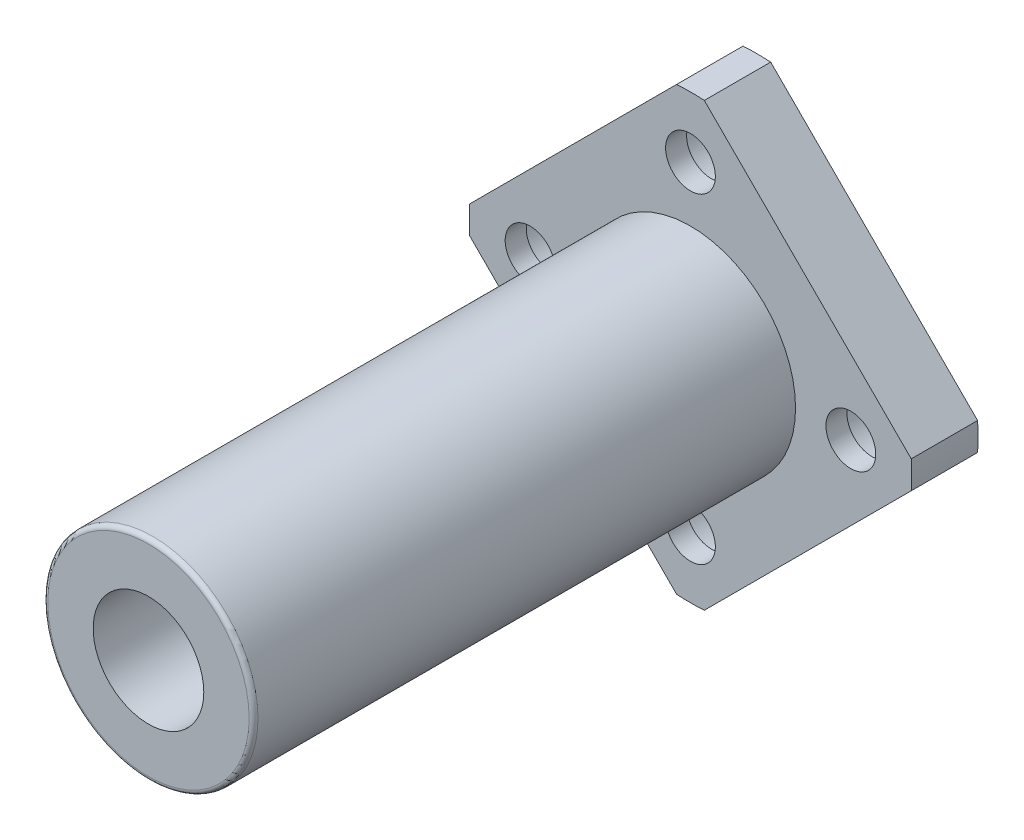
ISO-10303-21;
HEADER;
FILE_DESCRIPTION(('STEP AP214'),'2;1');
FILE_NAME('part.step','',(''),(''),'','','');
FILE_SCHEMA(('AUTOMOTIVE_DESIGN { 1 0 10303 214 1 1 1 1 }'));
ENDSEC;
DATA;
#1=APPLICATION_CONTEXT('core data for automotive mechanical design processes');
#2=APPLICATION_PROTOCOL_DEFINITION('international standard','automotive_design',2000,#1);
#3=PRODUCT_CONTEXT('',#1,'mechanical');
#4=PRODUCT('Part','Part','',(#3));
#5=PRODUCT_RELATED_PRODUCT_CATEGORY('part','',(#4));
#6=PRODUCT_DEFINITION_FORMATION('','',#4);
#7=PRODUCT_DEFINITION_CONTEXT('part definition',#1,'design');
#8=PRODUCT_DEFINITION('design','',#6,#7);
#9=PRODUCT_DEFINITION_SHAPE('','',#8);
#10=(LENGTH_UNIT() NAMED_UNIT(*) SI_UNIT(.MILLI.,.METRE.));
#11=(NAMED_UNIT(*) PLANE_ANGLE_UNIT() SI_UNIT($,.RADIAN.));
#12=(NAMED_UNIT(*) SI_UNIT($,.STERADIAN.) SOLID_ANGLE_UNIT());
#13=UNCERTAINTY_MEASURE_WITH_UNIT(LENGTH_MEASURE(1.E-05),#10,'distance_accuracy_value','');
#14=(GEOMETRIC_REPRESENTATION_CONTEXT(3) GLOBAL_UNCERTAINTY_ASSIGNED_CONTEXT((#13)) GLOBAL_UNIT_ASSIGNED_CONTEXT((#10,
#11,#12)) REPRESENTATION_CONTEXT('',''));
#15=CARTESIAN_POINT('',(0.,0.,0.));
#16=DIRECTION('',(0.,0.,1.));
#17=DIRECTION('',(1.,0.,0.));
#18=AXIS2_PLACEMENT_3D('',#15,#16,#17);
#19=CARTESIAN_POINT('',(-14.5,0.,0.));
#20=DIRECTION('',(0.,0.,1.));
#21=DIRECTION('',(1.,0.,0.));
#22=AXIS2_PLACEMENT_3D('',#19,#20,#21);
#23=CYLINDRICAL_SURFACE('',#22,3.75);
#24=CARTESIAN_POINT('',(-14.5,0.,4.1));
#25=DIRECTION('',(0.,0.,1.));
#26=DIRECTION('',(1.,0.,0.));
#27=AXIS2_PLACEMENT_3D('',#24,#25,#26);
#28=CIRCLE('',#27,3.75);
#29=CARTESIAN_POINT('',(-10.75,0.,4.1));
#30=VERTEX_POINT('',#29);
#31=EDGE_CURVE('E19',#30,#30,#28,.F.);
#32=ORIENTED_EDGE('',*,*,#31,.F.);
#33=EDGE_LOOP('',(#32));
#34=FACE_BOUND('',#33,.T.);
#35=CARTESIAN_POINT('',(-14.5,0.,0.));
#36=DIRECTION('',(0.,0.,1.));
#37=DIRECTION('',(1.,0.,0.));
#38=AXIS2_PLACEMENT_3D('',#35,#36,#37);
#39=CIRCLE('',#38,3.75);
#40=CARTESIAN_POINT('',(-10.75,0.,0.));
#41=VERTEX_POINT('',#40);
#42=EDGE_CURVE('E249',#41,#41,#39,.T.);
#43=ORIENTED_EDGE('',*,*,#42,.F.);
#44=EDGE_LOOP('',(#43));
#45=FACE_BOUND('',#44,.T.);
#46=ADVANCED_FACE('F16',(#34,#45),#23,.F.);
#47=CARTESIAN_POINT('',(0.,14.5,0.));
#48=DIRECTION('',(0.,0.,1.));
#49=DIRECTION('',(1.,0.,0.));
#50=AXIS2_PLACEMENT_3D('',#47,#48,#49);
#51=CYLINDRICAL_SURFACE('',#50,3.75);
#52=CARTESIAN_POINT('',(0.,14.5,4.1));
#53=DIRECTION('',(0.,0.,1.));
#54=DIRECTION('',(1.,0.,0.));
#55=AXIS2_PLACEMENT_3D('',#52,#53,#54);
#56=CIRCLE('',#55,3.75);
#57=CARTESIAN_POINT('',(3.75,14.5,4.1));
#58=VERTEX_POINT('',#57);
#59=EDGE_CURVE('E251',#58,#58,#56,.F.);
#60=ORIENTED_EDGE('',*,*,#59,.F.);
#61=EDGE_LOOP('',(#60));
#62=FACE_BOUND('',#61,.T.);
#63=CARTESIAN_POINT('',(0.,14.5,0.));
#64=DIRECTION('',(0.,0.,1.));
#65=DIRECTION('',(1.,0.,0.));
#66=AXIS2_PLACEMENT_3D('',#63,#64,#65);
#67=CIRCLE('',#66,3.75);
#68=CARTESIAN_POINT('',(3.75,14.5,0.));
#69=VERTEX_POINT('',#68);
#70=EDGE_CURVE('E246',#69,#69,#67,.T.);
#71=ORIENTED_EDGE('',*,*,#70,.F.);
#72=EDGE_LOOP('',(#71));
#73=FACE_BOUND('',#72,.T.);
#74=ADVANCED_FACE('F161',(#62,#73),#51,.F.);
#75=CARTESIAN_POINT('',(0.,-14.5,6.));
#76=DIRECTION('',(0.,0.,-1.));
#77=DIRECTION('',(-1.,0.,0.));
#78=AXIS2_PLACEMENT_3D('',#75,#76,#77);
#79=CYLINDRICAL_SURFACE('',#78,3.75);
#80=CARTESIAN_POINT('',(0.,-14.5,0.));
#81=DIRECTION('',(0.,0.,-1.));
#82=DIRECTION('',(-1.,0.,0.));
#83=AXIS2_PLACEMENT_3D('',#80,#81,#82);
#84=CIRCLE('',#83,3.75);
#85=CARTESIAN_POINT('',(-3.75,-14.5,0.));
#86=VERTEX_POINT('',#85);
#87=EDGE_CURVE('E240',#86,#86,#84,.F.);
#88=ORIENTED_EDGE('',*,*,#87,.F.);
#89=EDGE_LOOP('',(#88));
#90=FACE_BOUND('',#89,.T.);
#91=CARTESIAN_POINT('',(0.,-14.5,4.1));
#92=DIRECTION('',(0.,0.,-1.));
#93=DIRECTION('',(-1.,0.,0.));
#94=AXIS2_PLACEMENT_3D('',#91,#92,#93);
#95=CIRCLE('',#94,3.75);
#96=CARTESIAN_POINT('',(-3.75,-14.5,4.1));
#97=VERTEX_POINT('',#96);
#98=EDGE_CURVE('E234',#97,#97,#95,.T.);
#99=ORIENTED_EDGE('',*,*,#98,.F.);
#100=EDGE_LOOP('',(#99));
#101=FACE_BOUND('',#100,.T.);
#102=ADVANCED_FACE('F158',(#90,#101),#79,.F.);
#103=CARTESIAN_POINT('',(14.5,0.,6.));
#104=DIRECTION('',(0.,0.,-1.));
#105=DIRECTION('',(-1.,0.,0.));
#106=AXIS2_PLACEMENT_3D('',#103,#104,#105);
#107=CYLINDRICAL_SURFACE('',#106,3.75);
#108=CARTESIAN_POINT('',(14.5,0.,0.));
#109=DIRECTION('',(0.,0.,-1.));
#110=DIRECTION('',(-1.,0.,0.));
#111=AXIS2_PLACEMENT_3D('',#108,#109,#110);
#112=CIRCLE('',#111,3.75);
#113=CARTESIAN_POINT('',(10.75,0.,0.));
#114=VERTEX_POINT('',#113);
#115=EDGE_CURVE('E237',#114,#114,#112,.F.);
#116=ORIENTED_EDGE('',*,*,#115,.F.);
#117=EDGE_LOOP('',(#116));
#118=FACE_BOUND('',#117,.T.);
#119=CARTESIAN_POINT('',(14.5,0.,4.1));
#120=DIRECTION('',(0.,0.,-1.));
#121=DIRECTION('',(-1.,0.,0.));
#122=AXIS2_PLACEMENT_3D('',#119,#120,#121);
#123=CIRCLE('',#122,3.75);
#124=CARTESIAN_POINT('',(10.75,0.,4.1));
#125=VERTEX_POINT('',#124);
#126=EDGE_CURVE('E231',#125,#125,#123,.T.);
#127=ORIENTED_EDGE('',*,*,#126,.F.);
#128=EDGE_LOOP('',(#127));
#129=FACE_BOUND('',#128,.T.);
#130=ADVANCED_FACE('F154',(#118,#129),#107,.F.);
#131=CARTESIAN_POINT('',(0.,0.,0.));
#132=DIRECTION('',(0.,0.,1.));
#133=DIRECTION('',(1.,0.,0.));
#134=AXIS2_PLACEMENT_3D('',#131,#132,#133);
#135=CYLINDRICAL_SURFACE('',#134,5.);
#136=CARTESIAN_POINT('',(0.,0.,55.));
#137=DIRECTION('',(0.,0.,1.));
#138=DIRECTION('',(1.,0.,0.));
#139=AXIS2_PLACEMENT_3D('',#136,#137,#138);
#140=CIRCLE('',#139,5.);
#141=CARTESIAN_POINT('',(5.,0.,55.));
#142=VERTEX_POINT('',#141);
#143=EDGE_CURVE('E228',#142,#142,#140,.F.);
#144=ORIENTED_EDGE('',*,*,#143,.F.);
#145=EDGE_LOOP('',(#144));
#146=FACE_BOUND('',#145,.T.);
#147=CARTESIAN_POINT('',(0.,0.,0.));
#148=DIRECTION('',(0.,0.,1.));
#149=DIRECTION('',(1.,0.,0.));
#150=AXIS2_PLACEMENT_3D('',#147,#148,#149);
#151=CIRCLE('',#150,5.);
#152=CARTESIAN_POINT('',(5.,0.,0.));
#153=VERTEX_POINT('',#152);
#154=EDGE_CURVE('E243',#153,#153,#151,.T.);
#155=ORIENTED_EDGE('',*,*,#154,.F.);
#156=EDGE_LOOP('',(#155));
#157=FACE_BOUND('',#156,.T.);
#158=ADVANCED_FACE('F150',(#146,#157),#135,.F.);
#159=CARTESIAN_POINT('',(-16.75,0.,4.1));
#160=DIRECTION('',(0.,0.,-1.));
#161=DIRECTION('',(-1.,0.,0.));
#162=AXIS2_PLACEMENT_3D('',#159,#160,#161);
#163=PLANE('',#162);
#164=CARTESIAN_POINT('',(-14.5,0.,4.1));
#165=DIRECTION('',(0.,0.,1.));
#166=DIRECTION('',(1.,0.,0.));
#167=AXIS2_PLACEMENT_3D('',#164,#165,#166);
#168=CIRCLE('',#167,2.25);
#169=CARTESIAN_POINT('',(-12.25,0.,4.1));
#170=VERTEX_POINT('',#169);
#171=EDGE_CURVE('E225',#170,#170,#168,.T.);
#172=ORIENTED_EDGE('',*,*,#171,.T.);
#173=EDGE_LOOP('',(#172));
#174=FACE_BOUND('',#173,.T.);
#175=ORIENTED_EDGE('',*,*,#31,.T.);
#176=EDGE_LOOP('',(#175));
#177=FACE_BOUND('',#176,.T.);
#178=ADVANCED_FACE('F146',(#174,#177),#163,.T.);
#179=CARTESIAN_POINT('',(0.,16.75,4.1));
#180=DIRECTION('',(0.,0.,-1.));
#181=DIRECTION('',(-1.,0.,0.));
#182=AXIS2_PLACEMENT_3D('',#179,#180,#181);
#183=PLANE('',#182);
#184=CARTESIAN_POINT('',(0.,14.5,4.1));
#185=DIRECTION('',(0.,0.,1.));
#186=DIRECTION('',(1.,0.,0.));
#187=AXIS2_PLACEMENT_3D('',#184,#185,#186);
#188=CIRCLE('',#187,2.25);
#189=CARTESIAN_POINT('',(2.25,14.5,4.1));
#190=VERTEX_POINT('',#189);
#191=EDGE_CURVE('E222',#190,#190,#188,.T.);
#192=ORIENTED_EDGE('',*,*,#191,.T.);
#193=EDGE_LOOP('',(#192));
#194=FACE_BOUND('',#193,.T.);
#195=ORIENTED_EDGE('',*,*,#59,.T.);
#196=EDGE_LOOP('',(#195));
#197=FACE_BOUND('',#196,.T.);
#198=ADVANCED_FACE('F142',(#194,#197),#183,.T.);
#199=CARTESIAN_POINT('',(0.,5.,0.));
#200=DIRECTION('',(0.,0.,-1.));
#201=DIRECTION('',(-1.,0.,0.));
#202=AXIS2_PLACEMENT_3D('',#199,#200,#201);
#203=PLANE('',#202);
#204=ORIENTED_EDGE('',*,*,#115,.T.);
#205=EDGE_LOOP('',(#204));
#206=FACE_BOUND('',#205,.T.);
#207=ORIENTED_EDGE('',*,*,#87,.T.);
#208=EDGE_LOOP('',(#207));
#209=FACE_BOUND('',#208,.T.);
#210=DIRECTION('',(-0.707106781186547,0.707106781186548,0.));
#211=VECTOR('',#210,1.);
#212=CARTESIAN_POINT('',(-19.9607451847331,-1.25245825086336,0.));
#213=LINE('',#212,#211);
#214=CARTESIAN_POINT('',(-1.25245825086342,-19.960745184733,0.));
#215=VERTEX_POINT('',#214);
#216=CARTESIAN_POINT('',(-19.960745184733,-1.25245825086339,0.));
#217=VERTEX_POINT('',#216);
#218=EDGE_CURVE('E92',#215,#217,#213,.T.);
#219=ORIENTED_EDGE('',*,*,#218,.T.);
#220=CARTESIAN_POINT('',(5.34294830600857E-13,0.,0.));
#221=DIRECTION('',(0.,0.,1.));
#222=DIRECTION('',(1.,0.,0.));
#223=AXIS2_PLACEMENT_3D('',#220,#221,#222);
#224=CIRCLE('',#223,20.0000000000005);
#225=CARTESIAN_POINT('',(-19.960745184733,1.25245825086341,0.));
#226=VERTEX_POINT('',#225);
#227=EDGE_CURVE('E79',#226,#217,#224,.T.);
#228=ORIENTED_EDGE('',*,*,#227,.F.);
#229=DIRECTION('',(0.707106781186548,0.707106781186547,0.));
#230=VECTOR('',#229,1.);
#231=CARTESIAN_POINT('',(-1.25245825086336,19.9607451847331,0.));
#232=LINE('',#231,#230);
#233=CARTESIAN_POINT('',(-1.25245825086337,19.960745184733,0.));
#234=VERTEX_POINT('',#233);
#235=EDGE_CURVE('E89',#226,#234,#232,.T.);
#236=ORIENTED_EDGE('',*,*,#235,.T.);
#237=CARTESIAN_POINT('',(0.,-4.92661467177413E-13,0.));
#238=DIRECTION('',(0.,0.,1.));
#239=DIRECTION('',(1.,0.,0.));
#240=AXIS2_PLACEMENT_3D('',#237,#238,#239);
#241=CIRCLE('',#240,20.0000000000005);
#242=CARTESIAN_POINT('',(1.25245825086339,19.960745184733,0.));
#243=VERTEX_POINT('',#242);
#244=EDGE_CURVE('E202',#243,#234,#241,.T.);
#245=ORIENTED_EDGE('',*,*,#244,.F.);
#246=DIRECTION('',(0.707106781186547,-0.707106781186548,0.));
#247=VECTOR('',#246,1.);
#248=CARTESIAN_POINT('',(19.9607451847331,1.25245825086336,0.));
#249=LINE('',#248,#247);
#250=CARTESIAN_POINT('',(19.960745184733,1.2524582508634,0.));
#251=VERTEX_POINT('',#250);
#252=EDGE_CURVE('E207',#243,#251,#249,.T.);
#253=ORIENTED_EDGE('',*,*,#252,.T.);
#254=CARTESIAN_POINT('',(-4.33680868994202E-13,0.,0.));
#255=DIRECTION('',(0.,0.,1.));
#256=DIRECTION('',(1.,0.,0.));
#257=AXIS2_PLACEMENT_3D('',#254,#255,#256);
#258=CIRCLE('',#257,20.0000000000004);
#259=CARTESIAN_POINT('',(19.960745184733,-1.25245825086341,0.));
#260=VERTEX_POINT('',#259);
#261=EDGE_CURVE('E210',#260,#251,#258,.T.);
#262=ORIENTED_EDGE('',*,*,#261,.F.);
#263=DIRECTION('',(-0.707106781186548,-0.707106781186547,0.));
#264=VECTOR('',#263,1.);
#265=CARTESIAN_POINT('',(1.25245825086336,-19.9607451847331,0.));
#266=LINE('',#265,#264);
#267=CARTESIAN_POINT('',(1.25245825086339,-19.960745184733,0.));
#268=VERTEX_POINT('',#267);
#269=EDGE_CURVE('E212',#260,#268,#266,.T.);
#270=ORIENTED_EDGE('',*,*,#269,.T.);
#271=CARTESIAN_POINT('',(0.,1.33226762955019E-12,0.));
#272=DIRECTION('',(0.,0.,1.));
#273=DIRECTION('',(1.,0.,0.));
#274=AXIS2_PLACEMENT_3D('',#271,#272,#273);
#275=CIRCLE('',#274,20.0000000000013);
#276=EDGE_CURVE('E96',#215,#268,#275,.T.);
#277=ORIENTED_EDGE('',*,*,#276,.F.);
#278=EDGE_LOOP('',(#219,#228,#236,#245,#253,#262,#270,#277));
#279=FACE_BOUND('',#278,.T.);
#280=ORIENTED_EDGE('',*,*,#154,.T.);
#281=EDGE_LOOP('',(#280));
#282=FACE_BOUND('',#281,.T.);
#283=ORIENTED_EDGE('',*,*,#70,.T.);
#284=EDGE_LOOP('',(#283));
#285=FACE_BOUND('',#284,.T.);
#286=ORIENTED_EDGE('',*,*,#42,.T.);
#287=EDGE_LOOP('',(#286));
#288=FACE_BOUND('',#287,.T.);
#289=ADVANCED_FACE('F93',(#206,#209,#279,#282,#285,#288),#203,.T.);
#290=CARTESIAN_POINT('',(0.,-18.25,4.1));
#291=DIRECTION('',(0.,0.,-1.));
#292=DIRECTION('',(-1.,0.,0.));
#293=AXIS2_PLACEMENT_3D('',#290,#291,#292);
#294=PLANE('',#293);
#295=ORIENTED_EDGE('',*,*,#98,.T.);
#296=EDGE_LOOP('',(#295));
#297=FACE_BOUND('',#296,.T.);
#298=CARTESIAN_POINT('',(0.,-14.5,4.1));
#299=DIRECTION('',(0.,0.,-1.));
#300=DIRECTION('',(-1.,0.,0.));
#301=AXIS2_PLACEMENT_3D('',#298,#299,#300);
#302=CIRCLE('',#301,2.25);
#303=CARTESIAN_POINT('',(-2.25,-14.5,4.1));
#304=VERTEX_POINT('',#303);
#305=EDGE_CURVE('E204',#304,#304,#302,.F.);
#306=ORIENTED_EDGE('',*,*,#305,.T.);
#307=EDGE_LOOP('',(#306));
#308=FACE_BOUND('',#307,.T.);
#309=ADVANCED_FACE('F135',(#297,#308),#294,.T.);
#310=CARTESIAN_POINT('',(18.25,0.,4.1));
#311=DIRECTION('',(0.,0.,-1.));
#312=DIRECTION('',(-1.,0.,0.));
#313=AXIS2_PLACEMENT_3D('',#310,#311,#312);
#314=PLANE('',#313);
#315=ORIENTED_EDGE('',*,*,#126,.T.);
#316=EDGE_LOOP('',(#315));
#317=FACE_BOUND('',#316,.T.);
#318=CARTESIAN_POINT('',(14.5,0.,4.1));
#319=DIRECTION('',(0.,0.,-1.));
#320=DIRECTION('',(-1.,0.,0.));
#321=AXIS2_PLACEMENT_3D('',#318,#319,#320);
#322=CIRCLE('',#321,2.25);
#323=CARTESIAN_POINT('',(12.25,0.,4.1));
#324=VERTEX_POINT('',#323);
#325=EDGE_CURVE('E272',#324,#324,#322,.F.);
#326=ORIENTED_EDGE('',*,*,#325,.T.);
#327=EDGE_LOOP('',(#326));
#328=FACE_BOUND('',#327,.T.);
#329=ADVANCED_FACE('F131',(#317,#328),#314,.T.);
#330=CARTESIAN_POINT('',(0.,9.1,55.));
#331=DIRECTION('',(0.,0.,1.));
#332=DIRECTION('',(1.,0.,0.));
#333=AXIS2_PLACEMENT_3D('',#330,#331,#332);
#334=PLANE('',#333);
#335=CARTESIAN_POINT('',(0.,0.,55.));
#336=DIRECTION('',(0.,0.,-1.));
#337=DIRECTION('',(-1.,0.,0.));
#338=AXIS2_PLACEMENT_3D('',#335,#336,#337);
#339=CIRCLE('',#338,9.1);
#340=CARTESIAN_POINT('',(-9.1,0.,55.));
#341=VERTEX_POINT('',#340);
#342=EDGE_CURVE('E114',#341,#341,#339,.T.);
#343=ORIENTED_EDGE('',*,*,#342,.F.);
#344=EDGE_LOOP('',(#343));
#345=FACE_BOUND('',#344,.T.);
#346=ORIENTED_EDGE('',*,*,#143,.T.);
#347=EDGE_LOOP('',(#346));
#348=FACE_BOUND('',#347,.T.);
#349=ADVANCED_FACE('F120',(#345,#348),#334,.T.);
#350=CARTESIAN_POINT('',(-14.5,0.,0.));
#351=DIRECTION('',(0.,0.,1.));
#352=DIRECTION('',(1.,0.,0.));
#353=AXIS2_PLACEMENT_3D('',#350,#351,#352);
#354=CYLINDRICAL_SURFACE('',#353,2.25);
#355=CARTESIAN_POINT('',(-14.5,0.,6.));
#356=DIRECTION('',(0.,0.,1.));
#357=DIRECTION('',(1.,0.,0.));
#358=AXIS2_PLACEMENT_3D('',#355,#356,#357);
#359=CIRCLE('',#358,2.25);
#360=CARTESIAN_POINT('',(-12.25,0.,6.));
#361=VERTEX_POINT('',#360);
#362=EDGE_CURVE('E307',#361,#361,#359,.F.);
#363=ORIENTED_EDGE('',*,*,#362,.F.);
#364=EDGE_LOOP('',(#363));
#365=FACE_BOUND('',#364,.T.);
#366=ORIENTED_EDGE('',*,*,#171,.F.);
#367=EDGE_LOOP('',(#366));
#368=FACE_BOUND('',#367,.T.);
#369=ADVANCED_FACE('F130',(#365,#368),#354,.F.);
#370=CARTESIAN_POINT('',(0.,14.5,0.));
#371=DIRECTION('',(0.,0.,1.));
#372=DIRECTION('',(1.,0.,0.));
#373=AXIS2_PLACEMENT_3D('',#370,#371,#372);
#374=CYLINDRICAL_SURFACE('',#373,2.25);
#375=CARTESIAN_POINT('',(0.,14.5,6.));
#376=DIRECTION('',(0.,0.,1.));
#377=DIRECTION('',(1.,0.,0.));
#378=AXIS2_PLACEMENT_3D('',#375,#376,#377);
#379=CIRCLE('',#378,2.25);
#380=CARTESIAN_POINT('',(2.25,14.5,6.));
#381=VERTEX_POINT('',#380);
#382=EDGE_CURVE('E305',#381,#381,#379,.F.);
#383=ORIENTED_EDGE('',*,*,#382,.F.);
#384=EDGE_LOOP('',(#383));
#385=FACE_BOUND('',#384,.T.);
#386=ORIENTED_EDGE('',*,*,#191,.F.);
#387=EDGE_LOOP('',(#386));
#388=FACE_BOUND('',#387,.T.);
#389=ADVANCED_FACE('F315',(#385,#388),#374,.F.);
#390=CARTESIAN_POINT('',(-1.25245825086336,19.9607451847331,6.));
#391=DIRECTION('',(0.707106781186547,-0.707106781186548,0.));
#392=DIRECTION('',(0.707106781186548,0.707106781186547,0.));
#393=AXIS2_PLACEMENT_3D('',#390,#391,#392);
#394=PLANE('',#393);
#395=DIRECTION('',(0.,0.,1.));
#396=VECTOR('',#395,1.);
#397=CARTESIAN_POINT('',(-19.960745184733,1.25245825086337,6.));
#398=LINE('',#397,#396);
#399=CARTESIAN_POINT('',(-19.960745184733,1.25245825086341,6.));
#400=VERTEX_POINT('',#399);
#401=EDGE_CURVE('E88',#400,#226,#398,.F.);
#402=ORIENTED_EDGE('',*,*,#401,.F.);
#403=DIRECTION('',(-0.707106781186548,-0.707106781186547,0.));
#404=VECTOR('',#403,1.);
#405=CARTESIAN_POINT('',(-1.25245825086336,19.9607451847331,6.));
#406=LINE('',#405,#404);
#407=CARTESIAN_POINT('',(-1.25245825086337,19.960745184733,6.));
#408=VERTEX_POINT('',#407);
#409=EDGE_CURVE('E197',#408,#400,#406,.T.);
#410=ORIENTED_EDGE('',*,*,#409,.F.);
#411=DIRECTION('',(0.,0.,1.));
#412=VECTOR('',#411,1.);
#413=CARTESIAN_POINT('',(-1.25245825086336,19.9607451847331,6.));
#414=LINE('',#413,#412);
#415=EDGE_CURVE('E199',#234,#408,#414,.T.);
#416=ORIENTED_EDGE('',*,*,#415,.F.);
#417=ORIENTED_EDGE('',*,*,#235,.F.);
#418=EDGE_LOOP('',(#402,#410,#416,#417));
#419=FACE_BOUND('',#418,.T.);
#420=ADVANCED_FACE('F321',(#419),#394,.F.);
#421=CARTESIAN_POINT('',(5.34294830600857E-13,0.,6.));
#422=DIRECTION('',(0.,0.,1.));
#423=DIRECTION('',(1.,0.,0.));
#424=AXIS2_PLACEMENT_3D('',#421,#422,#423);
#425=CYLINDRICAL_SURFACE('',#424,20.0000000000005);
#426=CARTESIAN_POINT('',(5.34294830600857E-13,0.,6.));
#427=DIRECTION('',(0.,0.,1.));
#428=DIRECTION('',(1.,0.,0.));
#429=AXIS2_PLACEMENT_3D('',#426,#427,#428);
#430=CIRCLE('',#429,20.0000000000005);
#431=CARTESIAN_POINT('',(-19.960745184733,-1.25245825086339,6.));
#432=VERTEX_POINT('',#431);
#433=EDGE_CURVE('E303',#400,#432,#430,.T.);
#434=ORIENTED_EDGE('',*,*,#433,.F.);
#435=ORIENTED_EDGE('',*,*,#401,.T.);
#436=ORIENTED_EDGE('',*,*,#227,.T.);
#437=DIRECTION('',(0.,0.,1.));
#438=VECTOR('',#437,1.);
#439=CARTESIAN_POINT('',(-19.9607451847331,-1.25245825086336,6.));
#440=LINE('',#439,#438);
#441=EDGE_CURVE('E86',#217,#432,#440,.T.);
#442=ORIENTED_EDGE('',*,*,#441,.T.);
#443=EDGE_LOOP('',(#434,#435,#436,#442));
#444=FACE_BOUND('',#443,.T.);
#445=ADVANCED_FACE('F84',(#444),#425,.T.);
#446=CARTESIAN_POINT('',(-19.9607451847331,-1.25245825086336,6.));
#447=DIRECTION('',(0.707106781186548,0.707106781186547,0.));
#448=DIRECTION('',(-0.707106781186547,0.707106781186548,0.));
#449=AXIS2_PLACEMENT_3D('',#446,#447,#448);
#450=PLANE('',#449);
#451=DIRECTION('',(0.,0.,1.));
#452=VECTOR('',#451,1.);
#453=CARTESIAN_POINT('',(-1.25245825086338,-19.960745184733,6.));
#454=LINE('',#453,#452);
#455=CARTESIAN_POINT('',(-1.25245825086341,-19.960745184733,6.));
#456=VERTEX_POINT('',#455);
#457=EDGE_CURVE('E107',#456,#215,#454,.F.);
#458=ORIENTED_EDGE('',*,*,#457,.F.);
#459=DIRECTION('',(0.707106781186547,-0.707106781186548,0.));
#460=VECTOR('',#459,1.);
#461=CARTESIAN_POINT('',(-19.9607451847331,-1.25245825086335,6.));
#462=LINE('',#461,#460);
#463=EDGE_CURVE('E102',#432,#456,#462,.T.);
#464=ORIENTED_EDGE('',*,*,#463,.F.);
#465=ORIENTED_EDGE('',*,*,#441,.F.);
#466=ORIENTED_EDGE('',*,*,#218,.F.);
#467=EDGE_LOOP('',(#458,#464,#465,#466));
#468=FACE_BOUND('',#467,.T.);
#469=ADVANCED_FACE('F100',(#468),#450,.F.);
#470=CARTESIAN_POINT('',(0.,1.33226762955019E-12,6.));
#471=DIRECTION('',(0.,0.,1.));
#472=DIRECTION('',(1.,0.,0.));
#473=AXIS2_PLACEMENT_3D('',#470,#471,#472);
#474=CYLINDRICAL_SURFACE('',#473,20.0000000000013);
#475=CARTESIAN_POINT('',(0.,1.33226762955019E-12,6.));
#476=DIRECTION('',(0.,0.,1.));
#477=DIRECTION('',(1.,0.,0.));
#478=AXIS2_PLACEMENT_3D('',#475,#476,#477);
#479=CIRCLE('',#478,20.0000000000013);
#480=CARTESIAN_POINT('',(1.25245825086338,-19.960745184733,6.));
#481=VERTEX_POINT('',#480);
#482=EDGE_CURVE('E300',#456,#481,#479,.T.);
#483=ORIENTED_EDGE('',*,*,#482,.F.);
#484=ORIENTED_EDGE('',*,*,#457,.T.);
#485=ORIENTED_EDGE('',*,*,#276,.T.);
#486=DIRECTION('',(0.,0.,1.));
#487=VECTOR('',#486,1.);
#488=CARTESIAN_POINT('',(1.25245825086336,-19.9607451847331,6.));
#489=LINE('',#488,#487);
#490=EDGE_CURVE('E211',#268,#481,#489,.T.);
#491=ORIENTED_EDGE('',*,*,#490,.T.);
#492=EDGE_LOOP('',(#483,#484,#485,#491));
#493=FACE_BOUND('',#492,.T.);
#494=ADVANCED_FACE('F336',(#493),#474,.T.);
#495=CARTESIAN_POINT('',(1.25245825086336,-19.9607451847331,6.));
#496=DIRECTION('',(-0.707106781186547,0.707106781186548,0.));
#497=DIRECTION('',(-0.707106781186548,-0.707106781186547,0.));
#498=AXIS2_PLACEMENT_3D('',#495,#496,#497);
#499=PLANE('',#498);
#500=DIRECTION('',(0.,0.,1.));
#501=VECTOR('',#500,1.);
#502=CARTESIAN_POINT('',(19.960745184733,-1.25245825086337,6.));
#503=LINE('',#502,#501);
#504=CARTESIAN_POINT('',(19.960745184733,-1.25245825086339,6.));
#505=VERTEX_POINT('',#504);
#506=EDGE_CURVE('E208',#505,#260,#503,.F.);
#507=ORIENTED_EDGE('',*,*,#506,.F.);
#508=DIRECTION('',(0.707106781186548,0.707106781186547,0.));
#509=VECTOR('',#508,1.);
#510=CARTESIAN_POINT('',(1.25245825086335,-19.9607451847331,6.));
#511=LINE('',#510,#509);
#512=EDGE_CURVE('E299',#481,#505,#511,.T.);
#513=ORIENTED_EDGE('',*,*,#512,.F.);
#514=ORIENTED_EDGE('',*,*,#490,.F.);
#515=ORIENTED_EDGE('',*,*,#269,.F.);
#516=EDGE_LOOP('',(#507,#513,#514,#515));
#517=FACE_BOUND('',#516,.T.);
#518=ADVANCED_FACE('F339',(#517),#499,.F.);
#519=CARTESIAN_POINT('',(-4.33680868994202E-13,0.,6.));
#520=DIRECTION('',(0.,0.,1.));
#521=DIRECTION('',(1.,0.,0.));
#522=AXIS2_PLACEMENT_3D('',#519,#520,#521);
#523=CYLINDRICAL_SURFACE('',#522,20.0000000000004);
#524=CARTESIAN_POINT('',(-4.33680868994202E-13,0.,6.));
#525=DIRECTION('',(0.,0.,1.));
#526=DIRECTION('',(1.,0.,0.));
#527=AXIS2_PLACEMENT_3D('',#524,#525,#526);
#528=CIRCLE('',#527,20.0000000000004);
#529=CARTESIAN_POINT('',(19.960745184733,1.25245825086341,6.));
#530=VERTEX_POINT('',#529);
#531=EDGE_CURVE('E296',#505,#530,#528,.T.);
#532=ORIENTED_EDGE('',*,*,#531,.F.);
#533=ORIENTED_EDGE('',*,*,#506,.T.);
#534=ORIENTED_EDGE('',*,*,#261,.T.);
#535=DIRECTION('',(0.,0.,1.));
#536=VECTOR('',#535,1.);
#537=CARTESIAN_POINT('',(19.9607451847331,1.25245825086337,6.));
#538=LINE('',#537,#536);
#539=EDGE_CURVE('E205',#251,#530,#538,.T.);
#540=ORIENTED_EDGE('',*,*,#539,.T.);
#541=EDGE_LOOP('',(#532,#533,#534,#540));
#542=FACE_BOUND('',#541,.T.);
#543=ADVANCED_FACE('F342',(#542),#523,.T.);
#544=CARTESIAN_POINT('',(19.9607451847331,1.25245825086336,6.));
#545=DIRECTION('',(-0.707106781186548,-0.707106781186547,0.));
#546=DIRECTION('',(0.707106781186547,-0.707106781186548,0.));
#547=AXIS2_PLACEMENT_3D('',#544,#545,#546);
#548=PLANE('',#547);
#549=DIRECTION('',(0.,0.,1.));
#550=VECTOR('',#549,1.);
#551=CARTESIAN_POINT('',(1.25245825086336,19.9607451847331,6.));
#552=LINE('',#551,#550);
#553=CARTESIAN_POINT('',(1.25245825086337,19.9607451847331,6.));
#554=VERTEX_POINT('',#553);
#555=EDGE_CURVE('E34',#554,#243,#552,.F.);
#556=ORIENTED_EDGE('',*,*,#555,.F.);
#557=DIRECTION('',(-0.707106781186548,0.707106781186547,0.));
#558=VECTOR('',#557,1.);
#559=CARTESIAN_POINT('',(19.9607451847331,1.25245825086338,6.));
#560=LINE('',#559,#558);
#561=EDGE_CURVE('E295',#530,#554,#560,.T.);
#562=ORIENTED_EDGE('',*,*,#561,.F.);
#563=ORIENTED_EDGE('',*,*,#539,.F.);
#564=ORIENTED_EDGE('',*,*,#252,.F.);
#565=EDGE_LOOP('',(#556,#562,#563,#564));
#566=FACE_BOUND('',#565,.T.);
#567=ADVANCED_FACE('F346',(#566),#548,.F.);
#568=CARTESIAN_POINT('',(0.,-4.92661467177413E-13,6.));
#569=DIRECTION('',(0.,0.,1.));
#570=DIRECTION('',(1.,0.,0.));
#571=AXIS2_PLACEMENT_3D('',#568,#569,#570);
#572=CYLINDRICAL_SURFACE('',#571,20.0000000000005);
#573=CARTESIAN_POINT('',(0.,-4.92661467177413E-13,6.));
#574=DIRECTION('',(0.,0.,1.));
#575=DIRECTION('',(1.,0.,0.));
#576=AXIS2_PLACEMENT_3D('',#573,#574,#575);
#577=CIRCLE('',#576,20.0000000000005);
#578=EDGE_CURVE('E292',#554,#408,#577,.T.);
#579=ORIENTED_EDGE('',*,*,#578,.F.);
#580=ORIENTED_EDGE('',*,*,#555,.T.);
#581=ORIENTED_EDGE('',*,*,#244,.T.);
#582=ORIENTED_EDGE('',*,*,#415,.T.);
#583=EDGE_LOOP('',(#579,#580,#581,#582));
#584=FACE_BOUND('',#583,.T.);
#585=ADVANCED_FACE('F350',(#584),#572,.T.);
#586=CARTESIAN_POINT('',(0.,-14.5,6.));
#587=DIRECTION('',(0.,0.,-1.));
#588=DIRECTION('',(-1.,0.,0.));
#589=AXIS2_PLACEMENT_3D('',#586,#587,#588);
#590=CYLINDRICAL_SURFACE('',#589,2.25);
#591=ORIENTED_EDGE('',*,*,#305,.F.);
#592=EDGE_LOOP('',(#591));
#593=FACE_BOUND('',#592,.T.);
#594=CARTESIAN_POINT('',(0.,-14.5,6.));
#595=DIRECTION('',(0.,0.,-1.));
#596=DIRECTION('',(-1.,0.,0.));
#597=AXIS2_PLACEMENT_3D('',#594,#595,#596);
#598=CIRCLE('',#597,2.25);
#599=CARTESIAN_POINT('',(-2.25,-14.5,6.));
#600=VERTEX_POINT('',#599);
#601=EDGE_CURVE('E289',#600,#600,#598,.T.);
#602=ORIENTED_EDGE('',*,*,#601,.F.);
#603=EDGE_LOOP('',(#602));
#604=FACE_BOUND('',#603,.T.);
#605=ADVANCED_FACE('F352',(#593,#604),#590,.F.);
#606=CARTESIAN_POINT('',(14.5,0.,6.));
#607=DIRECTION('',(0.,0.,-1.));
#608=DIRECTION('',(-1.,0.,0.));
#609=AXIS2_PLACEMENT_3D('',#606,#607,#608);
#610=CYLINDRICAL_SURFACE('',#609,2.25);
#611=ORIENTED_EDGE('',*,*,#325,.F.);
#612=EDGE_LOOP('',(#611));
#613=FACE_BOUND('',#612,.T.);
#614=CARTESIAN_POINT('',(14.5,0.,6.));
#615=DIRECTION('',(0.,0.,-1.));
#616=DIRECTION('',(-1.,0.,0.));
#617=AXIS2_PLACEMENT_3D('',#614,#615,#616);
#618=CIRCLE('',#617,2.25);
#619=CARTESIAN_POINT('',(12.25,0.,6.));
#620=VERTEX_POINT('',#619);
#621=EDGE_CURVE('E286',#620,#620,#618,.T.);
#622=ORIENTED_EDGE('',*,*,#621,.F.);
#623=EDGE_LOOP('',(#622));
#624=FACE_BOUND('',#623,.T.);
#625=ADVANCED_FACE('F191',(#613,#624),#610,.F.);
#626=CARTESIAN_POINT('',(0.,0.,54.6));
#627=DIRECTION('',(0.,0.,-1.));
#628=DIRECTION('',(-1.,0.,0.));
#629=AXIS2_PLACEMENT_3D('',#626,#627,#628);
#630=TOROIDAL_SURFACE('',#629,9.1,0.399999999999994);
#631=CARTESIAN_POINT('',(0.,0.,54.6));
#632=DIRECTION('',(0.,0.,1.));
#633=DIRECTION('',(1.,0.,0.));
#634=AXIS2_PLACEMENT_3D('',#631,#632,#633);
#635=CIRCLE('',#634,9.5);
#636=CARTESIAN_POINT('',(9.5,0.,54.6));
#637=VERTEX_POINT('',#636);
#638=EDGE_CURVE('E25',#637,#637,#635,.F.);
#639=ORIENTED_EDGE('',*,*,#638,.F.);
#640=EDGE_LOOP('',(#639));
#641=FACE_BOUND('',#640,.T.);
#642=ORIENTED_EDGE('',*,*,#342,.T.);
#643=EDGE_LOOP('',(#642));
#644=FACE_BOUND('',#643,.T.);
#645=ADVANCED_FACE('F182',(#641,#644),#630,.T.);
#646=CARTESIAN_POINT('',(5.34294830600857E-13,0.,6.));
#647=DIRECTION('',(0.,0.,1.));
#648=DIRECTION('',(1.,0.,0.));
#649=AXIS2_PLACEMENT_3D('',#646,#647,#648);
#650=PLANE('',#649);
#651=ORIENTED_EDGE('',*,*,#621,.T.);
#652=EDGE_LOOP('',(#651));
#653=FACE_BOUND('',#652,.T.);
#654=ORIENTED_EDGE('',*,*,#601,.T.);
#655=EDGE_LOOP('',(#654));
#656=FACE_BOUND('',#655,.T.);
#657=ORIENTED_EDGE('',*,*,#561,.T.);
#658=ORIENTED_EDGE('',*,*,#578,.T.);
#659=ORIENTED_EDGE('',*,*,#409,.T.);
#660=ORIENTED_EDGE('',*,*,#433,.T.);
#661=ORIENTED_EDGE('',*,*,#463,.T.);
#662=ORIENTED_EDGE('',*,*,#482,.T.);
#663=ORIENTED_EDGE('',*,*,#512,.T.);
#664=ORIENTED_EDGE('',*,*,#531,.T.);
#665=EDGE_LOOP('',(#657,#658,#659,#660,#661,#662,#663,#664));
#666=FACE_BOUND('',#665,.T.);
#667=CARTESIAN_POINT('',(0.,0.,6.));
#668=DIRECTION('',(0.,0.,1.));
#669=DIRECTION('',(1.,0.,0.));
#670=AXIS2_PLACEMENT_3D('',#667,#668,#669);
#671=CIRCLE('',#670,9.5);
#672=CARTESIAN_POINT('',(9.5,0.,6.));
#673=VERTEX_POINT('',#672);
#674=EDGE_CURVE('E11',#673,#673,#671,.T.);
#675=ORIENTED_EDGE('',*,*,#674,.F.);
#676=EDGE_LOOP('',(#675));
#677=FACE_BOUND('',#676,.T.);
#678=ORIENTED_EDGE('',*,*,#382,.T.);
#679=EDGE_LOOP('',(#678));
#680=FACE_BOUND('',#679,.T.);
#681=ORIENTED_EDGE('',*,*,#362,.T.);
#682=EDGE_LOOP('',(#681));
#683=FACE_BOUND('',#682,.T.);
#684=ADVANCED_FACE('F175',(#653,#656,#666,#677,#680,#683),#650,.T.);
#685=CARTESIAN_POINT('',(0.,0.,0.));
#686=DIRECTION('',(0.,0.,1.));
#687=DIRECTION('',(1.,0.,0.));
#688=AXIS2_PLACEMENT_3D('',#685,#686,#687);
#689=CYLINDRICAL_SURFACE('',#688,9.5);
#690=ORIENTED_EDGE('',*,*,#674,.T.);
#691=EDGE_LOOP('',(#690));
#692=FACE_BOUND('',#691,.T.);
#693=ORIENTED_EDGE('',*,*,#638,.T.);
#694=EDGE_LOOP('',(#693));
#695=FACE_BOUND('',#694,.T.);
#696=ADVANCED_FACE('F173',(#692,#695),#689,.T.);
#697=CLOSED_SHELL('',(#46,#74,#102,#130,#158,#178,#198,#289,#309,#329,#349,#369,#389,#420,#445,
#469,#494,#518,#543,#567,#585,#605,#625,#645,#684,#696));
#698=MANIFOLD_SOLID_BREP('B1',#697);
#699=ADVANCED_BREP_SHAPE_REPRESENTATION('',(#18,#698),#14);
#700=SHAPE_DEFINITION_REPRESENTATION(#9,#699);
ENDSEC;
END-ISO-10303-21;
